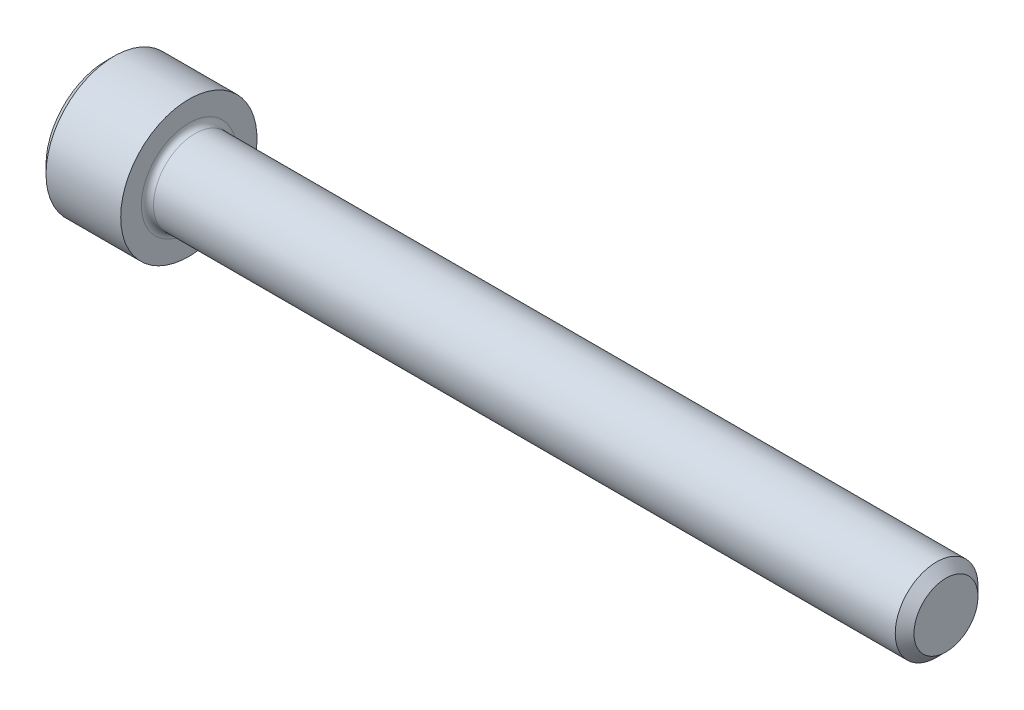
from build123d import *

# Parameters (mm, degrees)
FILLET1_R   = 0.3048
HEX_2_DEPTH = 1.9558


with BuildPart() as part:
    # BodySke → Base-Revolve (revolve)
    with BuildSketch(Plane.XY, mode=Mode.PRIVATE) as base_revolve_sk:
        Polygon((0, 0), (0, 3.0226), (0.4064, 3.429), (4.1656, 3.429), (4.1656, 2.0828), (41.79316, 2.0828), (42.2656, 1.61036), (42.2656, 0), align=None)
    revolve(base_revolve_sk.sketch.rotate(Axis((-31.75, 0, 0), (1, 0, 0)), 90), axis=Axis((-31.75, 0, 0), (1, 0, 0)))

    # Fillet1
    fillet1_edges = [part.edges().sort_by_distance(p)[0] for p in [
        (4.1656, 0, -2.0828),
    ]]
    fillet(fillet1_edges, radius=FILLET1_R)

    # Sketch2 → Hex-PreBroach (revolve, cut)
    with BuildSketch(Plane.XY, mode=Mode.PRIVATE) as hex_prebroach_sk:
        Polygon((0, 1.778), (1.9558, 1.778), (2.982328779, 0), (0, 0), align=None)
    revolve(hex_prebroach_sk.sketch.rotate(Axis((0, 0, 0), (1, 0, 0)), 90), axis=Axis((0, 0, 0), (1, 0, 0)), mode=Mode.SUBTRACT)

    # Sketch3 → Hex 2 (cut)
    with BuildSketch(Plane(origin=(0, 0, 0), x_dir=(0, 0.500000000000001, 0.866025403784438), z_dir=(-1, 0, 0))):
        Polygon((1.026528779, 1.778), (-1.026528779, 1.778), (-2.053057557, 0), (-1.026528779, -1.778), (1.026528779, -1.778), (2.053057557, 0), align=None)
    extrude(amount=-HEX_2_DEPTH, mode=Mode.SUBTRACT)


solid = part.part
